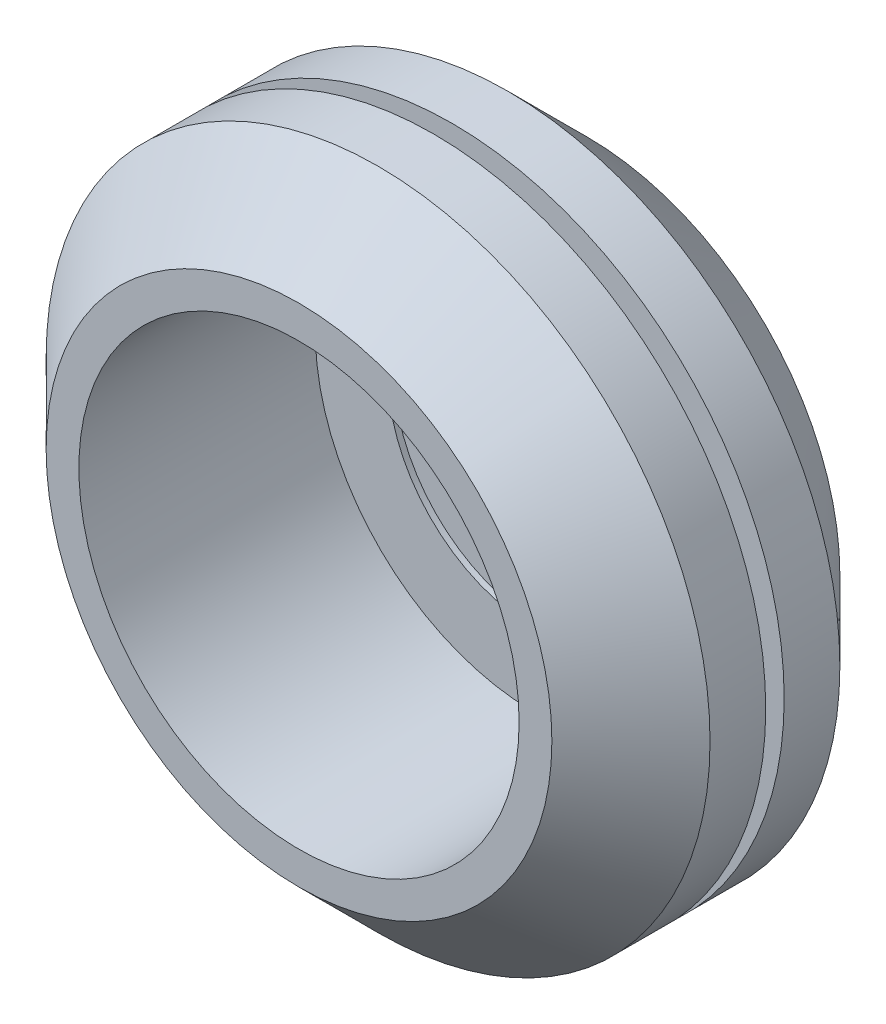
from build123d import *


with BuildPart() as part:
    # Sketch1 → Revolve6 (revolve)
    with BuildSketch(Plane(origin=(0, 0, 0), x_dir=(1, 0, 0), z_dir=(0, 1, 0)), mode=Mode.PRIVATE) as revolve6_sk:
        with BuildLine():
            Line((-7.14375, 1.397), (-7.14375, 0.1984375))
            Line((-7.14375, 0.1984375), (-6.35, 0.1984375))
            ThreePointArc((-6.35, 0.1984375), (-6.1515625, 0), (-6.35, -0.1984375))
            Line((-6.35, -0.1984375), (-7.14375, -0.1984375))
            Line((-7.14375, -0.1984375), (-7.14375, -1.397))
            Line((-7.14375, -1.397), (-5.44195, -3.0988))
            Line((-5.44195, -3.0988), (-4.7371, -3.0988))
            Line((-4.7371, -3.0988), (-4.7371, 1.987600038))
            Line((-4.7371, 1.987600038), (-3.175, 1.987600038))
            Line((-3.175, 1.987600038), (-3.175, 2.114600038))
            Line((-3.175, 2.114600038), (-1.905, 2.114600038))
            Line((-1.905, 2.114600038), (-1.905, 3.0988))
            Line((-1.905, 3.0988), (-5.44195, 3.0988))
            Line((-5.44195, 3.0988), (-7.14375, 1.397))
        make_face()
    revolve(revolve6_sk.sketch.rotate(Axis((0, 0, 0), (0, 0, -1)), 180), axis=Axis((0, 0, 0), (0, 0, -1)))


solid = part.part
